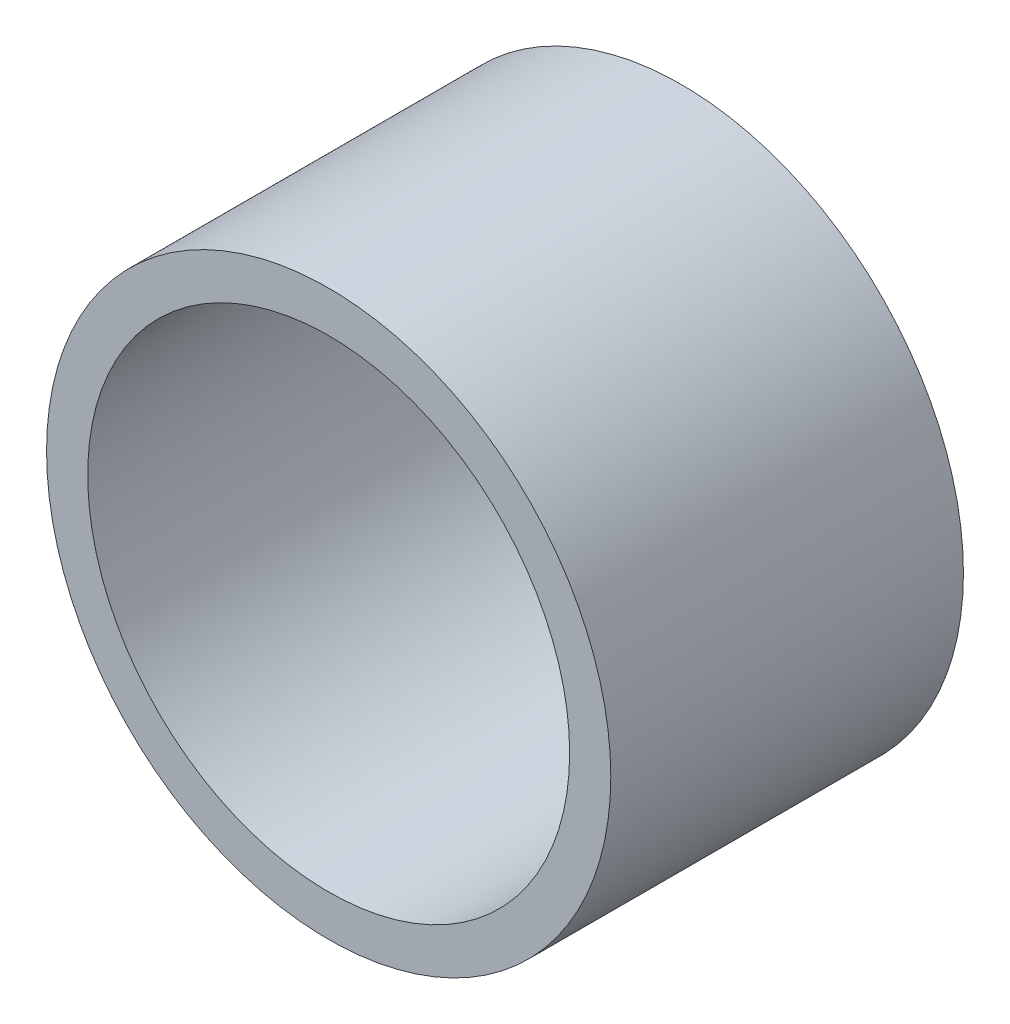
ISO-10303-21;
HEADER;
FILE_DESCRIPTION(('STEP AP214'),'2;1');
FILE_NAME('part.step','',(''),(''),'','','');
FILE_SCHEMA(('AUTOMOTIVE_DESIGN { 1 0 10303 214 1 1 1 1 }'));
ENDSEC;
DATA;
#1=APPLICATION_CONTEXT('core data for automotive mechanical design processes');
#2=APPLICATION_PROTOCOL_DEFINITION('international standard','automotive_design',2000,#1);
#3=PRODUCT_CONTEXT('',#1,'mechanical');
#4=PRODUCT('Part','Part','',(#3));
#5=PRODUCT_RELATED_PRODUCT_CATEGORY('part','',(#4));
#6=PRODUCT_DEFINITION_FORMATION('','',#4);
#7=PRODUCT_DEFINITION_CONTEXT('part definition',#1,'design');
#8=PRODUCT_DEFINITION('design','',#6,#7);
#9=PRODUCT_DEFINITION_SHAPE('','',#8);
#10=(LENGTH_UNIT() NAMED_UNIT(*) SI_UNIT(.MILLI.,.METRE.));
#11=(NAMED_UNIT(*) PLANE_ANGLE_UNIT() SI_UNIT($,.RADIAN.));
#12=(NAMED_UNIT(*) SI_UNIT($,.STERADIAN.) SOLID_ANGLE_UNIT());
#13=UNCERTAINTY_MEASURE_WITH_UNIT(LENGTH_MEASURE(1.E-05),#10,'distance_accuracy_value','');
#14=(GEOMETRIC_REPRESENTATION_CONTEXT(3) GLOBAL_UNCERTAINTY_ASSIGNED_CONTEXT((#13)) GLOBAL_UNIT_ASSIGNED_CONTEXT((#10,
#11,#12)) REPRESENTATION_CONTEXT('',''));
#15=CARTESIAN_POINT('',(0.,0.,0.));
#16=DIRECTION('',(0.,0.,1.));
#17=DIRECTION('',(1.,0.,0.));
#18=AXIS2_PLACEMENT_3D('',#15,#16,#17);
#19=CARTESIAN_POINT('',(0.,0.,15.));
#20=DIRECTION('',(0.,0.,1.));
#21=DIRECTION('',(1.,0.,0.));
#22=AXIS2_PLACEMENT_3D('',#19,#20,#21);
#23=PLANE('',#22);
#24=CARTESIAN_POINT('',(0.,0.,15.));
#25=DIRECTION('',(0.,0.,1.));
#26=DIRECTION('',(1.,0.,0.));
#27=AXIS2_PLACEMENT_3D('',#24,#25,#26);
#28=CIRCLE('',#27,12.);
#29=CARTESIAN_POINT('',(12.,0.,15.));
#30=VERTEX_POINT('',#29);
#31=EDGE_CURVE('E10',#30,#30,#28,.T.);
#32=ORIENTED_EDGE('',*,*,#31,.T.);
#33=EDGE_LOOP('',(#32));
#34=FACE_BOUND('',#33,.T.);
#35=CARTESIAN_POINT('',(0.,0.,15.));
#36=DIRECTION('',(0.,0.,1.));
#37=DIRECTION('',(1.,0.,0.));
#38=AXIS2_PLACEMENT_3D('',#35,#36,#37);
#39=CIRCLE('',#38,10.25);
#40=CARTESIAN_POINT('',(10.25,0.,15.));
#41=VERTEX_POINT('',#40);
#42=EDGE_CURVE('E43',#41,#41,#39,.T.);
#43=ORIENTED_EDGE('',*,*,#42,.F.);
#44=EDGE_LOOP('',(#43));
#45=FACE_BOUND('',#44,.T.);
#46=ADVANCED_FACE('F32',(#34,#45),#23,.T.);
#47=CARTESIAN_POINT('',(0.,0.,0.));
#48=DIRECTION('',(0.,0.,1.));
#49=DIRECTION('',(1.,0.,0.));
#50=AXIS2_PLACEMENT_3D('',#47,#48,#49);
#51=PLANE('',#50);
#52=CARTESIAN_POINT('',(0.,0.,0.));
#53=DIRECTION('',(0.,0.,1.));
#54=DIRECTION('',(1.,0.,0.));
#55=AXIS2_PLACEMENT_3D('',#52,#53,#54);
#56=CIRCLE('',#55,12.);
#57=CARTESIAN_POINT('',(12.,0.,0.));
#58=VERTEX_POINT('',#57);
#59=EDGE_CURVE('E36',#58,#58,#56,.T.);
#60=ORIENTED_EDGE('',*,*,#59,.F.);
#61=EDGE_LOOP('',(#60));
#62=FACE_BOUND('',#61,.T.);
#63=CARTESIAN_POINT('',(0.,0.,0.));
#64=DIRECTION('',(0.,0.,1.));
#65=DIRECTION('',(1.,0.,0.));
#66=AXIS2_PLACEMENT_3D('',#63,#64,#65);
#67=CIRCLE('',#66,10.25);
#68=CARTESIAN_POINT('',(10.25,0.,0.));
#69=VERTEX_POINT('',#68);
#70=EDGE_CURVE('E45',#69,#69,#67,.T.);
#71=ORIENTED_EDGE('',*,*,#70,.T.);
#72=EDGE_LOOP('',(#71));
#73=FACE_BOUND('',#72,.T.);
#74=ADVANCED_FACE('F55',(#62,#73),#51,.F.);
#75=CARTESIAN_POINT('',(0.,0.,15.));
#76=DIRECTION('',(0.,0.,-1.));
#77=DIRECTION('',(-1.,0.,0.));
#78=AXIS2_PLACEMENT_3D('',#75,#76,#77);
#79=CYLINDRICAL_SURFACE('',#78,12.);
#80=ORIENTED_EDGE('',*,*,#31,.F.);
#81=EDGE_LOOP('',(#80));
#82=FACE_BOUND('',#81,.T.);
#83=ORIENTED_EDGE('',*,*,#59,.T.);
#84=EDGE_LOOP('',(#83));
#85=FACE_BOUND('',#84,.T.);
#86=ADVANCED_FACE('F34',(#82,#85),#79,.T.);
#87=CARTESIAN_POINT('',(0.,0.,15.));
#88=DIRECTION('',(0.,0.,-1.));
#89=DIRECTION('',(-1.,0.,0.));
#90=AXIS2_PLACEMENT_3D('',#87,#88,#89);
#91=CYLINDRICAL_SURFACE('',#90,10.25);
#92=ORIENTED_EDGE('',*,*,#42,.T.);
#93=EDGE_LOOP('',(#92));
#94=FACE_BOUND('',#93,.T.);
#95=ORIENTED_EDGE('',*,*,#70,.F.);
#96=EDGE_LOOP('',(#95));
#97=FACE_BOUND('',#96,.T.);
#98=ADVANCED_FACE('F51',(#94,#97),#91,.F.);
#99=CLOSED_SHELL('',(#46,#74,#86,#98));
#100=MANIFOLD_SOLID_BREP('B2',#99);
#101=ADVANCED_BREP_SHAPE_REPRESENTATION('',(#18,#100),#14);
#102=SHAPE_DEFINITION_REPRESENTATION(#9,#101);
ENDSEC;
END-ISO-10303-21;
